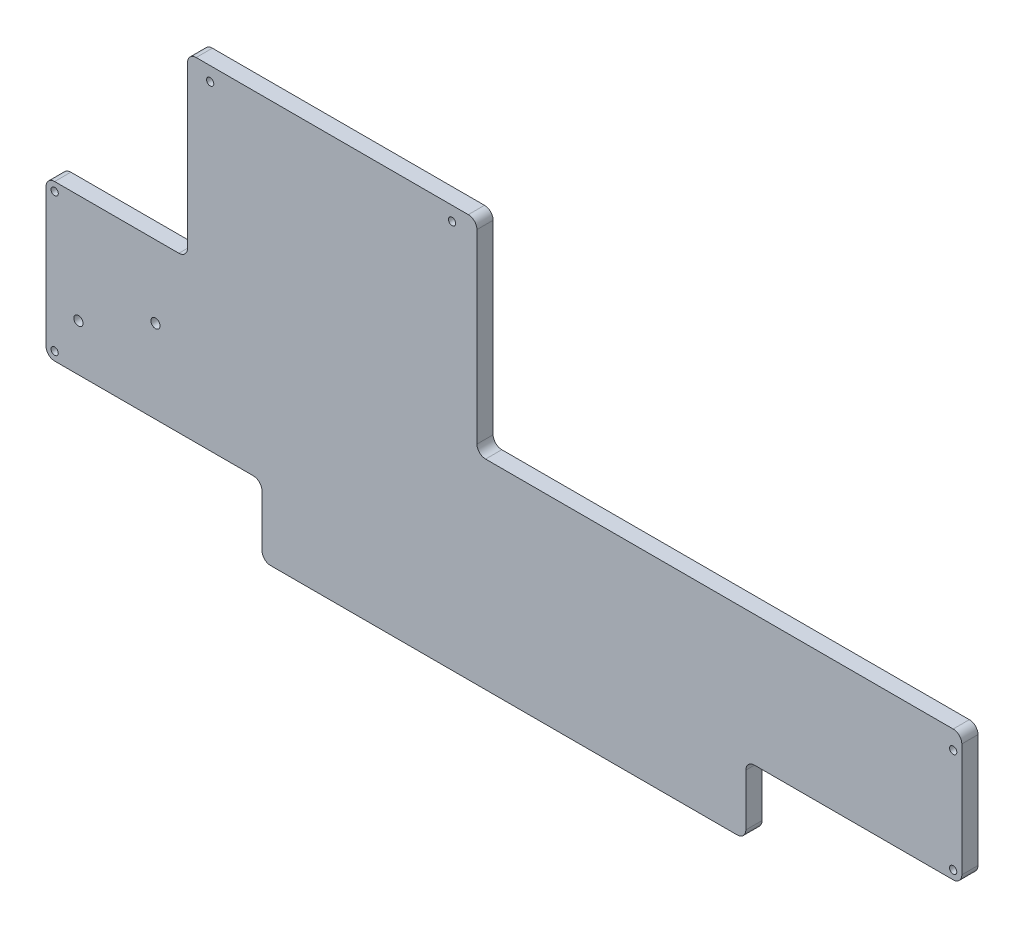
ISO-10303-21;
HEADER;
FILE_DESCRIPTION(('STEP AP214'),'2;1');
FILE_NAME('part.step','',(''),(''),'','','');
FILE_SCHEMA(('AUTOMOTIVE_DESIGN { 1 0 10303 214 1 1 1 1 }'));
ENDSEC;
DATA;
#1=APPLICATION_CONTEXT('core data for automotive mechanical design processes');
#2=APPLICATION_PROTOCOL_DEFINITION('international standard','automotive_design',2000,#1);
#3=PRODUCT_CONTEXT('',#1,'mechanical');
#4=PRODUCT('Part','Part','',(#3));
#5=PRODUCT_RELATED_PRODUCT_CATEGORY('part','',(#4));
#6=PRODUCT_DEFINITION_FORMATION('','',#4);
#7=PRODUCT_DEFINITION_CONTEXT('part definition',#1,'design');
#8=PRODUCT_DEFINITION('design','',#6,#7);
#9=PRODUCT_DEFINITION_SHAPE('','',#8);
#10=(LENGTH_UNIT() NAMED_UNIT(*) SI_UNIT(.MILLI.,.METRE.));
#11=(NAMED_UNIT(*) PLANE_ANGLE_UNIT() SI_UNIT($,.RADIAN.));
#12=(NAMED_UNIT(*) SI_UNIT($,.STERADIAN.) SOLID_ANGLE_UNIT());
#13=UNCERTAINTY_MEASURE_WITH_UNIT(LENGTH_MEASURE(1.E-05),#10,'distance_accuracy_value','');
#14=(GEOMETRIC_REPRESENTATION_CONTEXT(3) GLOBAL_UNCERTAINTY_ASSIGNED_CONTEXT((#13)) GLOBAL_UNIT_ASSIGNED_CONTEXT((#10,
#11,#12)) REPRESENTATION_CONTEXT('',''));
#15=CARTESIAN_POINT('',(0.,0.,0.));
#16=DIRECTION('',(0.,0.,1.));
#17=DIRECTION('',(1.,0.,0.));
#18=AXIS2_PLACEMENT_3D('',#15,#16,#17);
#19=CARTESIAN_POINT('',(3.5527136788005E-12,0.00125000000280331,136.144));
#20=DIRECTION('',(0.,0.,1.));
#21=DIRECTION('',(0.,-1.,0.));
#22=AXIS2_PLACEMENT_3D('',#19,#20,#21);
#23=PLANE('',#22);
#24=CARTESIAN_POINT('',(-215.899999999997,292.1,136.144));
#25=DIRECTION('',(0.,0.,1.));
#26=DIRECTION('',(0.,-1.,0.));
#27=AXIS2_PLACEMENT_3D('',#24,#25,#26);
#28=CIRCLE('',#27,2.667);
#29=CARTESIAN_POINT('',(-215.899999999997,289.433,136.144));
#30=VERTEX_POINT('',#29);
#31=EDGE_CURVE('E11',#30,#30,#28,.T.);
#32=ORIENTED_EDGE('',*,*,#31,.T.);
#33=EDGE_LOOP('',(#32));
#34=FACE_BOUND('',#33,.T.);
#35=CARTESIAN_POINT('',(-38.0999999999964,292.1,136.144));
#36=DIRECTION('',(0.,0.,1.));
#37=DIRECTION('',(0.,-1.,0.));
#38=AXIS2_PLACEMENT_3D('',#35,#36,#37);
#39=CIRCLE('',#38,2.667);
#40=CARTESIAN_POINT('',(-38.0999999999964,289.433,136.144));
#41=VERTEX_POINT('',#40);
#42=EDGE_CURVE('E200',#41,#41,#39,.T.);
#43=ORIENTED_EDGE('',*,*,#42,.T.);
#44=EDGE_LOOP('',(#43));
#45=FACE_BOUND('',#44,.T.);
#46=CARTESIAN_POINT('',(-13.4619999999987,159.512,136.144));
#47=DIRECTION('',(0.,0.,1.));
#48=DIRECTION('',(0.,-1.,0.));
#49=AXIS2_PLACEMENT_3D('',#46,#47,#48);
#50=CIRCLE('',#49,6.35);
#51=CARTESIAN_POINT('',(-19.8119999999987,159.512,136.144));
#52=VERTEX_POINT('',#51);
#53=CARTESIAN_POINT('',(-13.4619999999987,153.162,136.144));
#54=VERTEX_POINT('',#53);
#55=EDGE_CURVE('E492',#52,#54,#50,.T.);
#56=ORIENTED_EDGE('',*,*,#55,.T.);
#57=DIRECTION('',(-1.,0.,0.));
#58=VECTOR('',#57,1.);
#59=CARTESIAN_POINT('',(281.368499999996,153.162,136.144));
#60=LINE('',#59,#58);
#61=CARTESIAN_POINT('',(330.199999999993,153.162,136.144));
#62=VERTEX_POINT('',#61);
#63=EDGE_CURVE('E199',#62,#54,#60,.T.);
#64=ORIENTED_EDGE('',*,*,#63,.F.);
#65=CARTESIAN_POINT('',(330.199999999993,146.812,136.144));
#66=DIRECTION('',(0.,0.,1.));
#67=DIRECTION('',(0.,-1.,0.));
#68=AXIS2_PLACEMENT_3D('',#65,#66,#67);
#69=CIRCLE('',#68,6.35);
#70=CARTESIAN_POINT('',(336.549999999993,146.812,136.144));
#71=VERTEX_POINT('',#70);
#72=EDGE_CURVE('E212',#71,#62,#69,.T.);
#73=ORIENTED_EDGE('',*,*,#72,.F.);
#74=DIRECTION('',(0.,1.,0.));
#75=VECTOR('',#74,1.);
#76=CARTESIAN_POINT('',(336.549999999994,105.156,136.144));
#77=LINE('',#76,#75);
#78=CARTESIAN_POINT('',(336.549999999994,63.4999999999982,136.144));
#79=VERTEX_POINT('',#78);
#80=EDGE_CURVE('E218',#79,#71,#77,.T.);
#81=ORIENTED_EDGE('',*,*,#80,.F.);
#82=CARTESIAN_POINT('',(330.199999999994,63.4999999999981,136.144));
#83=DIRECTION('',(0.,0.,1.));
#84=DIRECTION('',(0.,-1.,0.));
#85=AXIS2_PLACEMENT_3D('',#82,#83,#84);
#86=CIRCLE('',#85,6.35);
#87=CARTESIAN_POINT('',(330.199999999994,57.1499999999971,136.144));
#88=VERTEX_POINT('',#87);
#89=EDGE_CURVE('E227',#88,#79,#86,.T.);
#90=ORIENTED_EDGE('',*,*,#89,.F.);
#91=DIRECTION('',(1.,0.,0.));
#92=VECTOR('',#91,1.);
#93=CARTESIAN_POINT('',(257.175,57.1499999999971,136.144));
#94=LINE('',#93,#92);
#95=CARTESIAN_POINT('',(184.15,57.15,136.144));
#96=VERTEX_POINT('',#95);
#97=EDGE_CURVE('E236',#96,#88,#94,.T.);
#98=ORIENTED_EDGE('',*,*,#97,.F.);
#99=CARTESIAN_POINT('',(184.15,50.8,136.144));
#100=DIRECTION('',(0.,0.,1.));
#101=DIRECTION('',(0.,-1.,0.));
#102=AXIS2_PLACEMENT_3D('',#99,#100,#101);
#103=CIRCLE('',#102,6.35);
#104=CARTESIAN_POINT('',(177.8,50.8,136.144));
#105=VERTEX_POINT('',#104);
#106=EDGE_CURVE('E250',#96,#105,#103,.T.);
#107=ORIENTED_EDGE('',*,*,#106,.T.);
#108=DIRECTION('',(0.,1.,0.));
#109=VECTOR('',#108,1.);
#110=CARTESIAN_POINT('',(177.8,31.7499999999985,136.144));
#111=LINE('',#110,#109);
#112=CARTESIAN_POINT('',(177.8,12.6999999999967,136.144));
#113=VERTEX_POINT('',#112);
#114=EDGE_CURVE('E260',#113,#105,#111,.T.);
#115=ORIENTED_EDGE('',*,*,#114,.F.);
#116=CARTESIAN_POINT('',(171.45,12.6999999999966,136.144));
#117=DIRECTION('',(0.,0.,1.));
#118=DIRECTION('',(0.,-1.,0.));
#119=AXIS2_PLACEMENT_3D('',#116,#117,#118);
#120=CIRCLE('',#119,6.35);
#121=CARTESIAN_POINT('',(171.45,6.34999999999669,136.144));
#122=VERTEX_POINT('',#121);
#123=EDGE_CURVE('E271',#122,#113,#120,.T.);
#124=ORIENTED_EDGE('',*,*,#123,.F.);
#125=DIRECTION('',(1.,0.,0.));
#126=VECTOR('',#125,1.);
#127=CARTESIAN_POINT('',(-2.77555756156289E-13,6.34999999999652,136.144));
#128=LINE('',#127,#126);
#129=CARTESIAN_POINT('',(-171.45,6.34999999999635,136.144));
#130=VERTEX_POINT('',#129);
#131=EDGE_CURVE('E335',#130,#122,#128,.T.);
#132=ORIENTED_EDGE('',*,*,#131,.F.);
#133=CARTESIAN_POINT('',(-171.45,12.6999999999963,136.144));
#134=DIRECTION('',(0.,0.,1.));
#135=DIRECTION('',(0.,-1.,0.));
#136=AXIS2_PLACEMENT_3D('',#133,#134,#135);
#137=CIRCLE('',#136,6.35);
#138=CARTESIAN_POINT('',(-177.8,12.6999999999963,136.144));
#139=VERTEX_POINT('',#138);
#140=EDGE_CURVE('E278',#139,#130,#137,.T.);
#141=ORIENTED_EDGE('',*,*,#140,.F.);
#142=DIRECTION('',(0.,-1.,0.));
#143=VECTOR('',#142,1.);
#144=CARTESIAN_POINT('',(-177.8,31.7499999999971,136.144));
#145=LINE('',#144,#143);
#146=CARTESIAN_POINT('',(-177.8,50.799999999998,136.144));
#147=VERTEX_POINT('',#146);
#148=EDGE_CURVE('E287',#147,#139,#145,.T.);
#149=ORIENTED_EDGE('',*,*,#148,.F.);
#150=CARTESIAN_POINT('',(-184.15,50.799999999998,136.144));
#151=DIRECTION('',(0.,0.,1.));
#152=DIRECTION('',(0.,-1.,0.));
#153=AXIS2_PLACEMENT_3D('',#150,#151,#152);
#154=CIRCLE('',#153,6.35);
#155=CARTESIAN_POINT('',(-184.15,57.1499999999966,136.144));
#156=VERTEX_POINT('',#155);
#157=EDGE_CURVE('E289',#147,#156,#154,.T.);
#158=ORIENTED_EDGE('',*,*,#157,.T.);
#159=DIRECTION('',(1.,0.,0.));
#160=VECTOR('',#159,1.);
#161=CARTESIAN_POINT('',(-257.175,57.1499999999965,136.144));
#162=LINE('',#161,#160);
#163=CARTESIAN_POINT('',(-330.199999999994,57.1499999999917,136.144));
#164=VERTEX_POINT('',#163);
#165=EDGE_CURVE('E304',#164,#156,#162,.T.);
#166=ORIENTED_EDGE('',*,*,#165,.F.);
#167=CARTESIAN_POINT('',(-330.199999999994,63.4999999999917,136.144));
#168=DIRECTION('',(0.,0.,1.));
#169=DIRECTION('',(0.,-1.,0.));
#170=AXIS2_PLACEMENT_3D('',#167,#168,#169);
#171=CIRCLE('',#170,6.35);
#172=CARTESIAN_POINT('',(-336.549999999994,63.4999999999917,136.144));
#173=VERTEX_POINT('',#172);
#174=EDGE_CURVE('E319',#173,#164,#171,.T.);
#175=ORIENTED_EDGE('',*,*,#174,.F.);
#176=DIRECTION('',(0.,-1.,0.));
#177=VECTOR('',#176,1.);
#178=CARTESIAN_POINT('',(-336.549999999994,114.299999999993,136.144));
#179=LINE('',#178,#177);
#180=CARTESIAN_POINT('',(-336.549999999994,165.099999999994,136.144));
#181=VERTEX_POINT('',#180);
#182=EDGE_CURVE('E345',#181,#173,#179,.T.);
#183=ORIENTED_EDGE('',*,*,#182,.F.);
#184=CARTESIAN_POINT('',(-330.199999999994,165.099999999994,136.144));
#185=DIRECTION('',(0.,0.,1.));
#186=DIRECTION('',(0.,-1.,0.));
#187=AXIS2_PLACEMENT_3D('',#184,#185,#186);
#188=CIRCLE('',#187,6.35);
#189=CARTESIAN_POINT('',(-330.199999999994,171.449999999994,136.144));
#190=VERTEX_POINT('',#189);
#191=EDGE_CURVE('E360',#190,#181,#188,.T.);
#192=ORIENTED_EDGE('',*,*,#191,.F.);
#193=DIRECTION('',(-1.,0.,0.));
#194=VECTOR('',#193,1.);
#195=CARTESIAN_POINT('',(-284.543499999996,171.449999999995,136.144));
#196=LINE('',#195,#194);
#197=CARTESIAN_POINT('',(-238.886999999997,171.449999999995,136.144));
#198=VERTEX_POINT('',#197);
#199=EDGE_CURVE('E372',#198,#190,#196,.T.);
#200=ORIENTED_EDGE('',*,*,#199,.F.);
#201=CARTESIAN_POINT('',(-238.886999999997,177.799999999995,136.144));
#202=DIRECTION('',(0.,0.,1.));
#203=DIRECTION('',(0.,-1.,0.));
#204=AXIS2_PLACEMENT_3D('',#201,#202,#203);
#205=CIRCLE('',#204,6.35);
#206=CARTESIAN_POINT('',(-232.536999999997,177.799999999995,136.144));
#207=VERTEX_POINT('',#206);
#208=EDGE_CURVE('E384',#198,#207,#205,.T.);
#209=ORIENTED_EDGE('',*,*,#208,.T.);
#210=DIRECTION('',(0.,-1.,0.));
#211=VECTOR('',#210,1.);
#212=CARTESIAN_POINT('',(-232.537,236.9185,136.144));
#213=LINE('',#212,#211);
#214=CARTESIAN_POINT('',(-232.537,296.037,136.144));
#215=VERTEX_POINT('',#214);
#216=EDGE_CURVE('E396',#215,#207,#213,.T.);
#217=ORIENTED_EDGE('',*,*,#216,.F.);
#218=CARTESIAN_POINT('',(-226.187,296.037,136.144));
#219=DIRECTION('',(0.,0.,1.));
#220=DIRECTION('',(0.,-1.,0.));
#221=AXIS2_PLACEMENT_3D('',#218,#219,#220);
#222=CIRCLE('',#221,6.35);
#223=CARTESIAN_POINT('',(-226.187,302.387,136.144));
#224=VERTEX_POINT('',#223);
#225=EDGE_CURVE('E411',#224,#215,#222,.T.);
#226=ORIENTED_EDGE('',*,*,#225,.F.);
#227=DIRECTION('',(-1.,0.,0.));
#228=VECTOR('',#227,1.);
#229=CARTESIAN_POINT('',(-126.174499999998,302.387,136.144));
#230=LINE('',#229,#228);
#231=CARTESIAN_POINT('',(-26.1619999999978,302.387,136.144));
#232=VERTEX_POINT('',#231);
#233=EDGE_CURVE('E422',#232,#224,#230,.T.);
#234=ORIENTED_EDGE('',*,*,#233,.F.);
#235=CARTESIAN_POINT('',(-26.1619999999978,296.037,136.144));
#236=DIRECTION('',(0.,0.,1.));
#237=DIRECTION('',(0.,-1.,0.));
#238=AXIS2_PLACEMENT_3D('',#235,#236,#237);
#239=CIRCLE('',#238,6.35);
#240=CARTESIAN_POINT('',(-19.8119999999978,296.037,136.144));
#241=VERTEX_POINT('',#240);
#242=EDGE_CURVE('E431',#241,#232,#239,.T.);
#243=ORIENTED_EDGE('',*,*,#242,.F.);
#244=DIRECTION('',(0.,1.,0.));
#245=VECTOR('',#244,1.);
#246=CARTESIAN_POINT('',(-19.8119999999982,227.7745,136.144));
#247=LINE('',#246,#245);
#248=EDGE_CURVE('E461',#52,#241,#247,.T.);
#249=ORIENTED_EDGE('',*,*,#248,.F.);
#250=EDGE_LOOP('',(#56,#64,#73,#81,#90,#98,#107,#115,#124,#132,#141,#149,#158,#166,#175,#183,
#192,#200,#209,#217,#226,#234,#243,#249));
#251=FACE_BOUND('',#250,.T.);
#252=CARTESIAN_POINT('',(330.199999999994,63.50000000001,136.144));
#253=DIRECTION('',(0.,0.,1.));
#254=DIRECTION('',(0.,-1.,0.));
#255=AXIS2_PLACEMENT_3D('',#252,#253,#254);
#256=CIRCLE('',#255,2.667);
#257=CARTESIAN_POINT('',(330.199999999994,60.83300000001,136.144));
#258=VERTEX_POINT('',#257);
#259=EDGE_CURVE('E324',#258,#258,#256,.T.);
#260=ORIENTED_EDGE('',*,*,#259,.T.);
#261=EDGE_LOOP('',(#260));
#262=FACE_BOUND('',#261,.T.);
#263=CARTESIAN_POINT('',(330.199999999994,139.70000000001,136.144));
#264=DIRECTION('',(0.,0.,1.));
#265=DIRECTION('',(0.,-1.,0.));
#266=AXIS2_PLACEMENT_3D('',#263,#264,#265);
#267=CIRCLE('',#266,2.667);
#268=CARTESIAN_POINT('',(330.199999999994,137.03300000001,136.144));
#269=VERTEX_POINT('',#268);
#270=EDGE_CURVE('E193',#269,#269,#267,.T.);
#271=ORIENTED_EDGE('',*,*,#270,.T.);
#272=EDGE_LOOP('',(#271));
#273=FACE_BOUND('',#272,.T.);
#274=CARTESIAN_POINT('',(-330.199999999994,63.499999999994,136.144));
#275=DIRECTION('',(0.,0.,1.));
#276=DIRECTION('',(0.,-1.,0.));
#277=AXIS2_PLACEMENT_3D('',#274,#275,#276);
#278=CIRCLE('',#277,2.667);
#279=CARTESIAN_POINT('',(-330.199999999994,60.832999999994,136.144));
#280=VERTEX_POINT('',#279);
#281=EDGE_CURVE('E186',#280,#280,#278,.T.);
#282=ORIENTED_EDGE('',*,*,#281,.T.);
#283=EDGE_LOOP('',(#282));
#284=FACE_BOUND('',#283,.T.);
#285=CARTESIAN_POINT('',(-330.199999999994,165.099999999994,136.144));
#286=DIRECTION('',(0.,0.,1.));
#287=DIRECTION('',(0.,-1.,0.));
#288=AXIS2_PLACEMENT_3D('',#285,#286,#287);
#289=CIRCLE('',#288,2.667);
#290=CARTESIAN_POINT('',(-330.199999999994,162.432999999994,136.144));
#291=VERTEX_POINT('',#290);
#292=EDGE_CURVE('E185',#291,#291,#289,.T.);
#293=ORIENTED_EDGE('',*,*,#292,.T.);
#294=EDGE_LOOP('',(#293));
#295=FACE_BOUND('',#294,.T.);
#296=CARTESIAN_POINT('',(-256.095499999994,118.237,136.144));
#297=DIRECTION('',(0.,0.,1.));
#298=DIRECTION('',(0.,-1.,0.));
#299=AXIS2_PLACEMENT_3D('',#296,#297,#298);
#300=CIRCLE('',#299,3.3782);
#301=CARTESIAN_POINT('',(-256.095499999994,114.8588,136.144));
#302=VERTEX_POINT('',#301);
#303=EDGE_CURVE('E175',#302,#302,#300,.T.);
#304=ORIENTED_EDGE('',*,*,#303,.T.);
#305=EDGE_LOOP('',(#304));
#306=FACE_BOUND('',#305,.T.);
#307=CARTESIAN_POINT('',(-312.737499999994,91.567,136.144));
#308=DIRECTION('',(0.,0.,1.));
#309=DIRECTION('',(0.,-1.,0.));
#310=AXIS2_PLACEMENT_3D('',#307,#308,#309);
#311=CIRCLE('',#310,3.3782);
#312=CARTESIAN_POINT('',(-312.737499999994,88.1888,136.144));
#313=VERTEX_POINT('',#312);
#314=EDGE_CURVE('E20',#313,#313,#311,.T.);
#315=ORIENTED_EDGE('',*,*,#314,.T.);
#316=EDGE_LOOP('',(#315));
#317=FACE_BOUND('',#316,.T.);
#318=ADVANCED_FACE('F17',(#34,#45,#251,#262,#273,#284,#295,#306,#317),#23,.F.);
#319=CARTESIAN_POINT('',(3.5527136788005E-12,0.00125000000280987,148.050250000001));
#320=DIRECTION('',(0.,0.,1.));
#321=DIRECTION('',(0.,-1.,0.));
#322=AXIS2_PLACEMENT_3D('',#319,#320,#321);
#323=PLANE('',#322);
#324=CARTESIAN_POINT('',(-215.899999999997,292.1,148.050250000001));
#325=DIRECTION('',(0.,0.,1.));
#326=DIRECTION('',(0.,-1.,0.));
#327=AXIS2_PLACEMENT_3D('',#324,#325,#326);
#328=CIRCLE('',#327,2.667);
#329=CARTESIAN_POINT('',(-215.899999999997,289.433,148.050250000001));
#330=VERTEX_POINT('',#329);
#331=EDGE_CURVE('E27',#330,#330,#328,.T.);
#332=ORIENTED_EDGE('',*,*,#331,.F.);
#333=EDGE_LOOP('',(#332));
#334=FACE_BOUND('',#333,.T.);
#335=CARTESIAN_POINT('',(-38.0999999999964,292.1,148.050250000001));
#336=DIRECTION('',(0.,0.,1.));
#337=DIRECTION('',(0.,-1.,0.));
#338=AXIS2_PLACEMENT_3D('',#335,#336,#337);
#339=CIRCLE('',#338,2.667);
#340=CARTESIAN_POINT('',(-38.0999999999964,289.433,148.050250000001));
#341=VERTEX_POINT('',#340);
#342=EDGE_CURVE('E203',#341,#341,#339,.T.);
#343=ORIENTED_EDGE('',*,*,#342,.F.);
#344=EDGE_LOOP('',(#343));
#345=FACE_BOUND('',#344,.T.);
#346=CARTESIAN_POINT('',(-13.4619999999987,159.512,148.050250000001));
#347=DIRECTION('',(0.,0.,1.));
#348=DIRECTION('',(0.,-1.,0.));
#349=AXIS2_PLACEMENT_3D('',#346,#347,#348);
#350=CIRCLE('',#349,6.35);
#351=CARTESIAN_POINT('',(-19.8119999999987,159.512,148.050250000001));
#352=VERTEX_POINT('',#351);
#353=CARTESIAN_POINT('',(-13.4619999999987,153.162,148.050250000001));
#354=VERTEX_POINT('',#353);
#355=EDGE_CURVE('E466',#352,#354,#350,.T.);
#356=ORIENTED_EDGE('',*,*,#355,.F.);
#357=DIRECTION('',(0.,1.,0.));
#358=VECTOR('',#357,1.);
#359=CARTESIAN_POINT('',(-19.8119999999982,227.7745,148.050250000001));
#360=LINE('',#359,#358);
#361=CARTESIAN_POINT('',(-19.8119999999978,296.037,148.050250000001));
#362=VERTEX_POINT('',#361);
#363=EDGE_CURVE('E442',#352,#362,#360,.T.);
#364=ORIENTED_EDGE('',*,*,#363,.T.);
#365=CARTESIAN_POINT('',(-26.1619999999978,296.037,148.050250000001));
#366=DIRECTION('',(0.,0.,1.));
#367=DIRECTION('',(0.,-1.,0.));
#368=AXIS2_PLACEMENT_3D('',#365,#366,#367);
#369=CIRCLE('',#368,6.35);
#370=CARTESIAN_POINT('',(-26.1619999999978,302.387,148.050250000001));
#371=VERTEX_POINT('',#370);
#372=EDGE_CURVE('E426',#362,#371,#369,.T.);
#373=ORIENTED_EDGE('',*,*,#372,.T.);
#374=DIRECTION('',(-1.,0.,0.));
#375=VECTOR('',#374,1.);
#376=CARTESIAN_POINT('',(-126.174499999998,302.387,148.050250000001));
#377=LINE('',#376,#375);
#378=CARTESIAN_POINT('',(-226.187,302.387,148.050250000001));
#379=VERTEX_POINT('',#378);
#380=EDGE_CURVE('E407',#371,#379,#377,.T.);
#381=ORIENTED_EDGE('',*,*,#380,.T.);
#382=CARTESIAN_POINT('',(-226.187,296.037,148.050250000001));
#383=DIRECTION('',(0.,0.,1.));
#384=DIRECTION('',(0.,-1.,0.));
#385=AXIS2_PLACEMENT_3D('',#382,#383,#384);
#386=CIRCLE('',#385,6.35);
#387=CARTESIAN_POINT('',(-232.537,296.037,148.050250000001));
#388=VERTEX_POINT('',#387);
#389=EDGE_CURVE('E400',#379,#388,#386,.T.);
#390=ORIENTED_EDGE('',*,*,#389,.T.);
#391=DIRECTION('',(0.,-1.,0.));
#392=VECTOR('',#391,1.);
#393=CARTESIAN_POINT('',(-232.537,236.9185,148.050250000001));
#394=LINE('',#393,#392);
#395=CARTESIAN_POINT('',(-232.536999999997,177.799999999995,148.050250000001));
#396=VERTEX_POINT('',#395);
#397=EDGE_CURVE('E388',#388,#396,#394,.T.);
#398=ORIENTED_EDGE('',*,*,#397,.T.);
#399=CARTESIAN_POINT('',(-238.886999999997,177.799999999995,148.050250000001));
#400=DIRECTION('',(0.,0.,1.));
#401=DIRECTION('',(0.,-1.,0.));
#402=AXIS2_PLACEMENT_3D('',#399,#400,#401);
#403=CIRCLE('',#402,6.35);
#404=CARTESIAN_POINT('',(-238.886999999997,171.449999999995,148.050250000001));
#405=VERTEX_POINT('',#404);
#406=EDGE_CURVE('E376',#405,#396,#403,.T.);
#407=ORIENTED_EDGE('',*,*,#406,.F.);
#408=DIRECTION('',(-1.,0.,0.));
#409=VECTOR('',#408,1.);
#410=CARTESIAN_POINT('',(-284.543499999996,171.449999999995,148.050250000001));
#411=LINE('',#410,#409);
#412=CARTESIAN_POINT('',(-330.199999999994,171.449999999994,148.050250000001));
#413=VERTEX_POINT('',#412);
#414=EDGE_CURVE('E364',#405,#413,#411,.T.);
#415=ORIENTED_EDGE('',*,*,#414,.T.);
#416=CARTESIAN_POINT('',(-330.199999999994,165.099999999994,148.050250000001));
#417=DIRECTION('',(0.,0.,1.));
#418=DIRECTION('',(0.,-1.,0.));
#419=AXIS2_PLACEMENT_3D('',#416,#417,#418);
#420=CIRCLE('',#419,6.35);
#421=CARTESIAN_POINT('',(-336.549999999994,165.099999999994,148.050250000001));
#422=VERTEX_POINT('',#421);
#423=EDGE_CURVE('E352',#413,#422,#420,.T.);
#424=ORIENTED_EDGE('',*,*,#423,.T.);
#425=DIRECTION('',(0.,-1.,0.));
#426=VECTOR('',#425,1.);
#427=CARTESIAN_POINT('',(-336.549999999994,114.299999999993,148.050250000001));
#428=LINE('',#427,#426);
#429=CARTESIAN_POINT('',(-336.549999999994,63.4999999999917,148.050250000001));
#430=VERTEX_POINT('',#429);
#431=EDGE_CURVE('E331',#422,#430,#428,.T.);
#432=ORIENTED_EDGE('',*,*,#431,.T.);
#433=CARTESIAN_POINT('',(-330.199999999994,63.4999999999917,148.050250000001));
#434=DIRECTION('',(0.,0.,1.));
#435=DIRECTION('',(0.,-1.,0.));
#436=AXIS2_PLACEMENT_3D('',#433,#434,#435);
#437=CIRCLE('',#436,6.35);
#438=CARTESIAN_POINT('',(-330.199999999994,57.1499999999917,148.050250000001));
#439=VERTEX_POINT('',#438);
#440=EDGE_CURVE('E308',#430,#439,#437,.T.);
#441=ORIENTED_EDGE('',*,*,#440,.T.);
#442=DIRECTION('',(1.,0.,0.));
#443=VECTOR('',#442,1.);
#444=CARTESIAN_POINT('',(-257.175,57.1499999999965,148.050250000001));
#445=LINE('',#444,#443);
#446=CARTESIAN_POINT('',(-184.15,57.1499999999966,148.050250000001));
#447=VERTEX_POINT('',#446);
#448=EDGE_CURVE('E293',#439,#447,#445,.T.);
#449=ORIENTED_EDGE('',*,*,#448,.T.);
#450=CARTESIAN_POINT('',(-184.15,50.7999999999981,148.050250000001));
#451=DIRECTION('',(0.,0.,1.));
#452=DIRECTION('',(0.,-1.,0.));
#453=AXIS2_PLACEMENT_3D('',#450,#451,#452);
#454=CIRCLE('',#453,6.35);
#455=CARTESIAN_POINT('',(-177.8,50.799999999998,148.050250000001));
#456=VERTEX_POINT('',#455);
#457=EDGE_CURVE('E283',#456,#447,#454,.T.);
#458=ORIENTED_EDGE('',*,*,#457,.F.);
#459=DIRECTION('',(0.,-1.,0.));
#460=VECTOR('',#459,1.);
#461=CARTESIAN_POINT('',(-177.8,31.7499999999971,148.050250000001));
#462=LINE('',#461,#460);
#463=CARTESIAN_POINT('',(-177.8,12.6999999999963,148.050250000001));
#464=VERTEX_POINT('',#463);
#465=EDGE_CURVE('E282',#456,#464,#462,.T.);
#466=ORIENTED_EDGE('',*,*,#465,.T.);
#467=CARTESIAN_POINT('',(-171.45,12.6999999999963,148.050250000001));
#468=DIRECTION('',(0.,0.,1.));
#469=DIRECTION('',(0.,-1.,0.));
#470=AXIS2_PLACEMENT_3D('',#467,#468,#469);
#471=CIRCLE('',#470,6.35);
#472=CARTESIAN_POINT('',(-171.45,6.34999999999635,148.050250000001));
#473=VERTEX_POINT('',#472);
#474=EDGE_CURVE('E277',#464,#473,#471,.T.);
#475=ORIENTED_EDGE('',*,*,#474,.T.);
#476=DIRECTION('',(1.,0.,0.));
#477=VECTOR('',#476,1.);
#478=CARTESIAN_POINT('',(-2.77555756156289E-13,6.34999999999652,148.050250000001));
#479=LINE('',#478,#477);
#480=CARTESIAN_POINT('',(171.45,6.3499999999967,148.050250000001));
#481=VERTEX_POINT('',#480);
#482=EDGE_CURVE('E267',#473,#481,#479,.T.);
#483=ORIENTED_EDGE('',*,*,#482,.T.);
#484=CARTESIAN_POINT('',(171.45,12.6999999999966,148.050250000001));
#485=DIRECTION('',(0.,0.,1.));
#486=DIRECTION('',(0.,-1.,0.));
#487=AXIS2_PLACEMENT_3D('',#484,#485,#486);
#488=CIRCLE('',#487,6.35);
#489=CARTESIAN_POINT('',(177.8,12.6999999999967,148.050250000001));
#490=VERTEX_POINT('',#489);
#491=EDGE_CURVE('E262',#481,#490,#488,.T.);
#492=ORIENTED_EDGE('',*,*,#491,.T.);
#493=DIRECTION('',(0.,1.,0.));
#494=VECTOR('',#493,1.);
#495=CARTESIAN_POINT('',(177.8,31.7499999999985,148.050250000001));
#496=LINE('',#495,#494);
#497=CARTESIAN_POINT('',(177.8,50.8,148.050250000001));
#498=VERTEX_POINT('',#497);
#499=EDGE_CURVE('E253',#490,#498,#496,.T.);
#500=ORIENTED_EDGE('',*,*,#499,.T.);
#501=CARTESIAN_POINT('',(184.15,50.8,148.050250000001));
#502=DIRECTION('',(0.,0.,1.));
#503=DIRECTION('',(0.,-1.,0.));
#504=AXIS2_PLACEMENT_3D('',#501,#502,#503);
#505=CIRCLE('',#504,6.35);
#506=CARTESIAN_POINT('',(184.15,57.15,148.050250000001));
#507=VERTEX_POINT('',#506);
#508=EDGE_CURVE('E240',#507,#498,#505,.T.);
#509=ORIENTED_EDGE('',*,*,#508,.F.);
#510=DIRECTION('',(1.,0.,0.));
#511=VECTOR('',#510,1.);
#512=CARTESIAN_POINT('',(257.175,57.1499999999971,148.050250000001));
#513=LINE('',#512,#511);
#514=CARTESIAN_POINT('',(330.199999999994,57.1499999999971,148.050250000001));
#515=VERTEX_POINT('',#514);
#516=EDGE_CURVE('E231',#507,#515,#513,.T.);
#517=ORIENTED_EDGE('',*,*,#516,.T.);
#518=CARTESIAN_POINT('',(330.199999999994,63.4999999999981,148.050250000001));
#519=DIRECTION('',(0.,0.,1.));
#520=DIRECTION('',(0.,-1.,0.));
#521=AXIS2_PLACEMENT_3D('',#518,#519,#520);
#522=CIRCLE('',#521,6.35);
#523=CARTESIAN_POINT('',(336.549999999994,63.4999999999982,148.050250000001));
#524=VERTEX_POINT('',#523);
#525=EDGE_CURVE('E222',#515,#524,#522,.T.);
#526=ORIENTED_EDGE('',*,*,#525,.T.);
#527=DIRECTION('',(0.,1.,0.));
#528=VECTOR('',#527,1.);
#529=CARTESIAN_POINT('',(336.549999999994,105.156,148.050250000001));
#530=LINE('',#529,#528);
#531=CARTESIAN_POINT('',(336.549999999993,146.812,148.050250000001));
#532=VERTEX_POINT('',#531);
#533=EDGE_CURVE('E213',#524,#532,#530,.T.);
#534=ORIENTED_EDGE('',*,*,#533,.T.);
#535=CARTESIAN_POINT('',(330.199999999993,146.812,148.050250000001));
#536=DIRECTION('',(0.,0.,1.));
#537=DIRECTION('',(0.,-1.,0.));
#538=AXIS2_PLACEMENT_3D('',#535,#536,#537);
#539=CIRCLE('',#538,6.35);
#540=CARTESIAN_POINT('',(330.199999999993,153.162,148.050250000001));
#541=VERTEX_POINT('',#540);
#542=EDGE_CURVE('E204',#532,#541,#539,.T.);
#543=ORIENTED_EDGE('',*,*,#542,.T.);
#544=DIRECTION('',(-1.,0.,0.));
#545=VECTOR('',#544,1.);
#546=CARTESIAN_POINT('',(281.368499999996,153.162,148.050250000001));
#547=LINE('',#546,#545);
#548=EDGE_CURVE('E194',#541,#354,#547,.T.);
#549=ORIENTED_EDGE('',*,*,#548,.T.);
#550=EDGE_LOOP('',(#356,#364,#373,#381,#390,#398,#407,#415,#424,#432,#441,#449,#458,#466,#475,
#483,#492,#500,#509,#517,#526,#534,#543,#549));
#551=FACE_BOUND('',#550,.T.);
#552=CARTESIAN_POINT('',(330.199999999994,63.50000000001,148.050250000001));
#553=DIRECTION('',(0.,0.,1.));
#554=DIRECTION('',(0.,-1.,0.));
#555=AXIS2_PLACEMENT_3D('',#552,#553,#554);
#556=CIRCLE('',#555,2.667);
#557=CARTESIAN_POINT('',(330.199999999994,60.83300000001,148.050250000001));
#558=VERTEX_POINT('',#557);
#559=EDGE_CURVE('E198',#558,#558,#556,.T.);
#560=ORIENTED_EDGE('',*,*,#559,.F.);
#561=EDGE_LOOP('',(#560));
#562=FACE_BOUND('',#561,.T.);
#563=CARTESIAN_POINT('',(330.199999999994,139.70000000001,148.050250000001));
#564=DIRECTION('',(0.,0.,1.));
#565=DIRECTION('',(0.,-1.,0.));
#566=AXIS2_PLACEMENT_3D('',#563,#564,#565);
#567=CIRCLE('',#566,2.667);
#568=CARTESIAN_POINT('',(330.199999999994,137.03300000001,148.050250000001));
#569=VERTEX_POINT('',#568);
#570=EDGE_CURVE('E327',#569,#569,#567,.T.);
#571=ORIENTED_EDGE('',*,*,#570,.F.);
#572=EDGE_LOOP('',(#571));
#573=FACE_BOUND('',#572,.T.);
#574=CARTESIAN_POINT('',(-330.199999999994,63.499999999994,148.050250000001));
#575=DIRECTION('',(0.,0.,1.));
#576=DIRECTION('',(0.,-1.,0.));
#577=AXIS2_PLACEMENT_3D('',#574,#575,#576);
#578=CIRCLE('',#577,2.667);
#579=CARTESIAN_POINT('',(-330.199999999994,60.832999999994,148.050250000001));
#580=VERTEX_POINT('',#579);
#581=EDGE_CURVE('E190',#580,#580,#578,.T.);
#582=ORIENTED_EDGE('',*,*,#581,.F.);
#583=EDGE_LOOP('',(#582));
#584=FACE_BOUND('',#583,.T.);
#585=CARTESIAN_POINT('',(-330.199999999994,165.099999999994,148.050250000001));
#586=DIRECTION('',(0.,0.,1.));
#587=DIRECTION('',(0.,-1.,0.));
#588=AXIS2_PLACEMENT_3D('',#585,#586,#587);
#589=CIRCLE('',#588,2.667);
#590=CARTESIAN_POINT('',(-330.199999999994,162.432999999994,148.050250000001));
#591=VERTEX_POINT('',#590);
#592=EDGE_CURVE('E189',#591,#591,#589,.T.);
#593=ORIENTED_EDGE('',*,*,#592,.F.);
#594=EDGE_LOOP('',(#593));
#595=FACE_BOUND('',#594,.T.);
#596=CARTESIAN_POINT('',(-256.095499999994,118.237,148.050250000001));
#597=DIRECTION('',(0.,0.,1.));
#598=DIRECTION('',(0.,-1.,0.));
#599=AXIS2_PLACEMENT_3D('',#596,#597,#598);
#600=CIRCLE('',#599,3.3782);
#601=CARTESIAN_POINT('',(-256.095499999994,114.8588,148.050250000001));
#602=VERTEX_POINT('',#601);
#603=EDGE_CURVE('E180',#602,#602,#600,.T.);
#604=ORIENTED_EDGE('',*,*,#603,.F.);
#605=EDGE_LOOP('',(#604));
#606=FACE_BOUND('',#605,.T.);
#607=CARTESIAN_POINT('',(-312.737499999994,91.567,148.050250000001));
#608=DIRECTION('',(0.,0.,1.));
#609=DIRECTION('',(0.,-1.,0.));
#610=AXIS2_PLACEMENT_3D('',#607,#608,#609);
#611=CIRCLE('',#610,3.3782);
#612=CARTESIAN_POINT('',(-312.737499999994,88.1888,148.050250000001));
#613=VERTEX_POINT('',#612);
#614=EDGE_CURVE('E169',#613,#613,#611,.T.);
#615=ORIENTED_EDGE('',*,*,#614,.F.);
#616=EDGE_LOOP('',(#615));
#617=FACE_BOUND('',#616,.T.);
#618=ADVANCED_FACE('F676',(#334,#345,#551,#562,#573,#584,#595,#606,#617),#323,.T.);
#619=CARTESIAN_POINT('',(-215.899999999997,292.1,148.050250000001));
#620=DIRECTION('',(0.,0.,-1.));
#621=DIRECTION('',(0.,1.,0.));
#622=AXIS2_PLACEMENT_3D('',#619,#620,#621);
#623=CYLINDRICAL_SURFACE('',#622,2.667);
#624=ORIENTED_EDGE('',*,*,#31,.F.);
#625=EDGE_LOOP('',(#624));
#626=FACE_BOUND('',#625,.T.);
#627=ORIENTED_EDGE('',*,*,#331,.T.);
#628=EDGE_LOOP('',(#627));
#629=FACE_BOUND('',#628,.T.);
#630=ADVANCED_FACE('F717',(#626,#629),#623,.F.);
#631=CARTESIAN_POINT('',(-312.737499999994,91.567,148.050250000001));
#632=DIRECTION('',(0.,0.,-1.));
#633=DIRECTION('',(0.,1.,0.));
#634=AXIS2_PLACEMENT_3D('',#631,#632,#633);
#635=CYLINDRICAL_SURFACE('',#634,3.3782);
#636=ORIENTED_EDGE('',*,*,#314,.F.);
#637=EDGE_LOOP('',(#636));
#638=FACE_BOUND('',#637,.T.);
#639=ORIENTED_EDGE('',*,*,#614,.T.);
#640=EDGE_LOOP('',(#639));
#641=FACE_BOUND('',#640,.T.);
#642=ADVANCED_FACE('F726',(#638,#641),#635,.F.);
#643=CARTESIAN_POINT('',(-256.095499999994,118.237,148.050250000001));
#644=DIRECTION('',(0.,0.,-1.));
#645=DIRECTION('',(0.,1.,0.));
#646=AXIS2_PLACEMENT_3D('',#643,#644,#645);
#647=CYLINDRICAL_SURFACE('',#646,3.3782);
#648=ORIENTED_EDGE('',*,*,#303,.F.);
#649=EDGE_LOOP('',(#648));
#650=FACE_BOUND('',#649,.T.);
#651=ORIENTED_EDGE('',*,*,#603,.T.);
#652=EDGE_LOOP('',(#651));
#653=FACE_BOUND('',#652,.T.);
#654=ADVANCED_FACE('F721',(#650,#653),#647,.F.);
#655=CARTESIAN_POINT('',(-330.199999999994,165.099999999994,148.050250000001));
#656=DIRECTION('',(0.,0.,-1.));
#657=DIRECTION('',(0.,1.,0.));
#658=AXIS2_PLACEMENT_3D('',#655,#656,#657);
#659=CYLINDRICAL_SURFACE('',#658,2.667);
#660=ORIENTED_EDGE('',*,*,#292,.F.);
#661=EDGE_LOOP('',(#660));
#662=FACE_BOUND('',#661,.T.);
#663=ORIENTED_EDGE('',*,*,#592,.T.);
#664=EDGE_LOOP('',(#663));
#665=FACE_BOUND('',#664,.T.);
#666=ADVANCED_FACE('F725',(#662,#665),#659,.F.);
#667=CARTESIAN_POINT('',(-330.199999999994,63.499999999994,148.050250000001));
#668=DIRECTION('',(0.,0.,-1.));
#669=DIRECTION('',(0.,1.,0.));
#670=AXIS2_PLACEMENT_3D('',#667,#668,#669);
#671=CYLINDRICAL_SURFACE('',#670,2.667);
#672=ORIENTED_EDGE('',*,*,#281,.F.);
#673=EDGE_LOOP('',(#672));
#674=FACE_BOUND('',#673,.T.);
#675=ORIENTED_EDGE('',*,*,#581,.T.);
#676=EDGE_LOOP('',(#675));
#677=FACE_BOUND('',#676,.T.);
#678=ADVANCED_FACE('F734',(#674,#677),#671,.F.);
#679=CARTESIAN_POINT('',(330.199999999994,139.70000000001,148.050250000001));
#680=DIRECTION('',(0.,0.,-1.));
#681=DIRECTION('',(0.,1.,0.));
#682=AXIS2_PLACEMENT_3D('',#679,#680,#681);
#683=CYLINDRICAL_SURFACE('',#682,2.667);
#684=ORIENTED_EDGE('',*,*,#270,.F.);
#685=EDGE_LOOP('',(#684));
#686=FACE_BOUND('',#685,.T.);
#687=ORIENTED_EDGE('',*,*,#570,.T.);
#688=EDGE_LOOP('',(#687));
#689=FACE_BOUND('',#688,.T.);
#690=ADVANCED_FACE('F742',(#686,#689),#683,.F.);
#691=CARTESIAN_POINT('',(330.199999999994,63.50000000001,148.050250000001));
#692=DIRECTION('',(0.,0.,-1.));
#693=DIRECTION('',(0.,1.,0.));
#694=AXIS2_PLACEMENT_3D('',#691,#692,#693);
#695=CYLINDRICAL_SURFACE('',#694,2.667);
#696=ORIENTED_EDGE('',*,*,#259,.F.);
#697=EDGE_LOOP('',(#696));
#698=FACE_BOUND('',#697,.T.);
#699=ORIENTED_EDGE('',*,*,#559,.T.);
#700=EDGE_LOOP('',(#699));
#701=FACE_BOUND('',#700,.T.);
#702=ADVANCED_FACE('F747',(#698,#701),#695,.F.);
#703=CARTESIAN_POINT('',(281.368499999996,153.162,148.050250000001));
#704=DIRECTION('',(0.,-1.,0.));
#705=DIRECTION('',(-1.,0.,0.));
#706=AXIS2_PLACEMENT_3D('',#703,#704,#705);
#707=PLANE('',#706);
#708=ORIENTED_EDGE('',*,*,#63,.T.);
#709=DIRECTION('',(0.,0.,-1.));
#710=VECTOR('',#709,1.);
#711=CARTESIAN_POINT('',(-13.4619999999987,153.162,148.050250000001));
#712=LINE('',#711,#710);
#713=EDGE_CURVE('E462',#354,#54,#712,.T.);
#714=ORIENTED_EDGE('',*,*,#713,.F.);
#715=ORIENTED_EDGE('',*,*,#548,.F.);
#716=DIRECTION('',(0.,0.,-1.));
#717=VECTOR('',#716,1.);
#718=CARTESIAN_POINT('',(330.199999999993,153.162,148.050250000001));
#719=LINE('',#718,#717);
#720=EDGE_CURVE('E208',#541,#62,#719,.T.);
#721=ORIENTED_EDGE('',*,*,#720,.T.);
#722=EDGE_LOOP('',(#708,#714,#715,#721));
#723=FACE_BOUND('',#722,.T.);
#724=ADVANCED_FACE('F680',(#723),#707,.F.);
#725=CARTESIAN_POINT('',(-38.0999999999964,292.1,148.050250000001));
#726=DIRECTION('',(0.,0.,-1.));
#727=DIRECTION('',(0.,1.,0.));
#728=AXIS2_PLACEMENT_3D('',#725,#726,#727);
#729=CYLINDRICAL_SURFACE('',#728,2.667);
#730=ORIENTED_EDGE('',*,*,#42,.F.);
#731=EDGE_LOOP('',(#730));
#732=FACE_BOUND('',#731,.T.);
#733=ORIENTED_EDGE('',*,*,#342,.T.);
#734=EDGE_LOOP('',(#733));
#735=FACE_BOUND('',#734,.T.);
#736=ADVANCED_FACE('F758',(#732,#735),#729,.F.);
#737=CARTESIAN_POINT('',(330.199999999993,146.812,148.050250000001));
#738=DIRECTION('',(0.,0.,-1.));
#739=DIRECTION('',(0.,1.,0.));
#740=AXIS2_PLACEMENT_3D('',#737,#738,#739);
#741=CYLINDRICAL_SURFACE('',#740,6.35);
#742=ORIENTED_EDGE('',*,*,#72,.T.);
#743=ORIENTED_EDGE('',*,*,#720,.F.);
#744=ORIENTED_EDGE('',*,*,#542,.F.);
#745=DIRECTION('',(0.,0.,-1.));
#746=VECTOR('',#745,1.);
#747=CARTESIAN_POINT('',(336.549999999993,146.812,148.050250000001));
#748=LINE('',#747,#746);
#749=EDGE_CURVE('E217',#532,#71,#748,.T.);
#750=ORIENTED_EDGE('',*,*,#749,.T.);
#751=EDGE_LOOP('',(#742,#743,#744,#750));
#752=FACE_BOUND('',#751,.T.);
#753=ADVANCED_FACE('F682',(#752),#741,.T.);
#754=CARTESIAN_POINT('',(336.549999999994,105.156,148.050250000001));
#755=DIRECTION('',(-1.,0.,0.));
#756=DIRECTION('',(0.,1.,0.));
#757=AXIS2_PLACEMENT_3D('',#754,#755,#756);
#758=PLANE('',#757);
#759=ORIENTED_EDGE('',*,*,#80,.T.);
#760=ORIENTED_EDGE('',*,*,#749,.F.);
#761=ORIENTED_EDGE('',*,*,#533,.F.);
#762=DIRECTION('',(0.,0.,-1.));
#763=VECTOR('',#762,1.);
#764=CARTESIAN_POINT('',(336.549999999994,63.4999999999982,148.050250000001));
#765=LINE('',#764,#763);
#766=EDGE_CURVE('E223',#524,#79,#765,.T.);
#767=ORIENTED_EDGE('',*,*,#766,.T.);
#768=EDGE_LOOP('',(#759,#760,#761,#767));
#769=FACE_BOUND('',#768,.T.);
#770=ADVANCED_FACE('F686',(#769),#758,.F.);
#771=CARTESIAN_POINT('',(330.199999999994,63.4999999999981,148.050250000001));
#772=DIRECTION('',(0.,0.,-1.));
#773=DIRECTION('',(0.,1.,0.));
#774=AXIS2_PLACEMENT_3D('',#771,#772,#773);
#775=CYLINDRICAL_SURFACE('',#774,6.35);
#776=ORIENTED_EDGE('',*,*,#89,.T.);
#777=ORIENTED_EDGE('',*,*,#766,.F.);
#778=ORIENTED_EDGE('',*,*,#525,.F.);
#779=DIRECTION('',(0.,0.,-1.));
#780=VECTOR('',#779,1.);
#781=CARTESIAN_POINT('',(330.199999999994,57.1499999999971,148.050250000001));
#782=LINE('',#781,#780);
#783=EDGE_CURVE('E232',#515,#88,#782,.T.);
#784=ORIENTED_EDGE('',*,*,#783,.T.);
#785=EDGE_LOOP('',(#776,#777,#778,#784));
#786=FACE_BOUND('',#785,.T.);
#787=ADVANCED_FACE('F688',(#786),#775,.T.);
#788=CARTESIAN_POINT('',(257.175,57.1499999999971,148.050250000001));
#789=DIRECTION('',(0.,1.,0.));
#790=DIRECTION('',(1.,0.,0.));
#791=AXIS2_PLACEMENT_3D('',#788,#789,#790);
#792=PLANE('',#791);
#793=ORIENTED_EDGE('',*,*,#97,.T.);
#794=ORIENTED_EDGE('',*,*,#783,.F.);
#795=ORIENTED_EDGE('',*,*,#516,.F.);
#796=DIRECTION('',(0.,0.,-1.));
#797=VECTOR('',#796,1.);
#798=CARTESIAN_POINT('',(184.15,57.15,148.050250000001));
#799=LINE('',#798,#797);
#800=EDGE_CURVE('E246',#507,#96,#799,.T.);
#801=ORIENTED_EDGE('',*,*,#800,.T.);
#802=EDGE_LOOP('',(#793,#794,#795,#801));
#803=FACE_BOUND('',#802,.T.);
#804=ADVANCED_FACE('F691',(#803),#792,.F.);
#805=CARTESIAN_POINT('',(184.15,50.8,148.050250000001));
#806=DIRECTION('',(0.,0.,-1.));
#807=DIRECTION('',(0.,1.,0.));
#808=AXIS2_PLACEMENT_3D('',#805,#806,#807);
#809=CYLINDRICAL_SURFACE('',#808,6.35);
#810=ORIENTED_EDGE('',*,*,#106,.F.);
#811=ORIENTED_EDGE('',*,*,#800,.F.);
#812=ORIENTED_EDGE('',*,*,#508,.T.);
#813=DIRECTION('',(0.,0.,-1.));
#814=VECTOR('',#813,1.);
#815=CARTESIAN_POINT('',(177.8,50.8,148.050250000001));
#816=LINE('',#815,#814);
#817=EDGE_CURVE('E257',#498,#105,#816,.T.);
#818=ORIENTED_EDGE('',*,*,#817,.T.);
#819=EDGE_LOOP('',(#810,#811,#812,#818));
#820=FACE_BOUND('',#819,.T.);
#821=ADVANCED_FACE('F696',(#820),#809,.F.);
#822=CARTESIAN_POINT('',(177.8,31.7499999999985,148.050250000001));
#823=DIRECTION('',(-1.,0.,0.));
#824=DIRECTION('',(0.,1.,0.));
#825=AXIS2_PLACEMENT_3D('',#822,#823,#824);
#826=PLANE('',#825);
#827=ORIENTED_EDGE('',*,*,#114,.T.);
#828=ORIENTED_EDGE('',*,*,#817,.F.);
#829=ORIENTED_EDGE('',*,*,#499,.F.);
#830=DIRECTION('',(0.,0.,-1.));
#831=VECTOR('',#830,1.);
#832=CARTESIAN_POINT('',(177.8,12.6999999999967,148.050250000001));
#833=LINE('',#832,#831);
#834=EDGE_CURVE('E266',#490,#113,#833,.T.);
#835=ORIENTED_EDGE('',*,*,#834,.T.);
#836=EDGE_LOOP('',(#827,#828,#829,#835));
#837=FACE_BOUND('',#836,.T.);
#838=ADVANCED_FACE('F699',(#837),#826,.F.);
#839=CARTESIAN_POINT('',(171.45,12.6999999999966,148.050250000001));
#840=DIRECTION('',(0.,0.,-1.));
#841=DIRECTION('',(0.,1.,0.));
#842=AXIS2_PLACEMENT_3D('',#839,#840,#841);
#843=CYLINDRICAL_SURFACE('',#842,6.35);
#844=ORIENTED_EDGE('',*,*,#123,.T.);
#845=ORIENTED_EDGE('',*,*,#834,.F.);
#846=ORIENTED_EDGE('',*,*,#491,.F.);
#847=DIRECTION('',(0.,0.,-1.));
#848=VECTOR('',#847,1.);
#849=CARTESIAN_POINT('',(171.45,6.3499999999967,148.050250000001));
#850=LINE('',#849,#848);
#851=EDGE_CURVE('E272',#481,#122,#850,.T.);
#852=ORIENTED_EDGE('',*,*,#851,.T.);
#853=EDGE_LOOP('',(#844,#845,#846,#852));
#854=FACE_BOUND('',#853,.T.);
#855=ADVANCED_FACE('F702',(#854),#843,.T.);
#856=CARTESIAN_POINT('',(-2.77555756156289E-13,6.34999999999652,148.050250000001));
#857=DIRECTION('',(0.,1.,0.));
#858=DIRECTION('',(1.,0.,0.));
#859=AXIS2_PLACEMENT_3D('',#856,#857,#858);
#860=PLANE('',#859);
#861=ORIENTED_EDGE('',*,*,#131,.T.);
#862=ORIENTED_EDGE('',*,*,#851,.F.);
#863=ORIENTED_EDGE('',*,*,#482,.F.);
#864=DIRECTION('',(0.,0.,-1.));
#865=VECTOR('',#864,1.);
#866=CARTESIAN_POINT('',(-171.45,6.34999999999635,148.050250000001));
#867=LINE('',#866,#865);
#868=EDGE_CURVE('E273',#473,#130,#867,.T.);
#869=ORIENTED_EDGE('',*,*,#868,.T.);
#870=EDGE_LOOP('',(#861,#862,#863,#869));
#871=FACE_BOUND('',#870,.T.);
#872=ADVANCED_FACE('F628',(#871),#860,.F.);
#873=CARTESIAN_POINT('',(-171.45,12.6999999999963,148.050250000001));
#874=DIRECTION('',(0.,0.,-1.));
#875=DIRECTION('',(0.,1.,0.));
#876=AXIS2_PLACEMENT_3D('',#873,#874,#875);
#877=CYLINDRICAL_SURFACE('',#876,6.35);
#878=ORIENTED_EDGE('',*,*,#140,.T.);
#879=ORIENTED_EDGE('',*,*,#868,.F.);
#880=ORIENTED_EDGE('',*,*,#474,.F.);
#881=DIRECTION('',(0.,0.,-1.));
#882=VECTOR('',#881,1.);
#883=CARTESIAN_POINT('',(-177.8,12.6999999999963,148.050250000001));
#884=LINE('',#883,#882);
#885=EDGE_CURVE('E323',#464,#139,#884,.T.);
#886=ORIENTED_EDGE('',*,*,#885,.T.);
#887=EDGE_LOOP('',(#878,#879,#880,#886));
#888=FACE_BOUND('',#887,.T.);
#889=ADVANCED_FACE('F629',(#888),#877,.T.);
#890=CARTESIAN_POINT('',(-177.8,31.7499999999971,148.050250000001));
#891=DIRECTION('',(1.,0.,0.));
#892=DIRECTION('',(0.,1.,0.));
#893=AXIS2_PLACEMENT_3D('',#890,#891,#892);
#894=PLANE('',#893);
#895=ORIENTED_EDGE('',*,*,#148,.T.);
#896=ORIENTED_EDGE('',*,*,#885,.F.);
#897=ORIENTED_EDGE('',*,*,#465,.F.);
#898=DIRECTION('',(0.,0.,-1.));
#899=VECTOR('',#898,1.);
#900=CARTESIAN_POINT('',(-177.8,50.799999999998,148.050250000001));
#901=LINE('',#900,#899);
#902=EDGE_CURVE('E288',#456,#147,#901,.T.);
#903=ORIENTED_EDGE('',*,*,#902,.T.);
#904=EDGE_LOOP('',(#895,#896,#897,#903));
#905=FACE_BOUND('',#904,.T.);
#906=ADVANCED_FACE('F632',(#905),#894,.F.);
#907=CARTESIAN_POINT('',(-184.15,50.7999999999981,148.050250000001));
#908=DIRECTION('',(0.,0.,-1.));
#909=DIRECTION('',(0.,1.,0.));
#910=AXIS2_PLACEMENT_3D('',#907,#908,#909);
#911=CYLINDRICAL_SURFACE('',#910,6.35);
#912=ORIENTED_EDGE('',*,*,#157,.F.);
#913=ORIENTED_EDGE('',*,*,#902,.F.);
#914=ORIENTED_EDGE('',*,*,#457,.T.);
#915=DIRECTION('',(0.,0.,-1.));
#916=VECTOR('',#915,1.);
#917=CARTESIAN_POINT('',(-184.15,57.1499999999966,148.050250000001));
#918=LINE('',#917,#916);
#919=EDGE_CURVE('E300',#447,#156,#918,.T.);
#920=ORIENTED_EDGE('',*,*,#919,.T.);
#921=EDGE_LOOP('',(#912,#913,#914,#920));
#922=FACE_BOUND('',#921,.T.);
#923=ADVANCED_FACE('F637',(#922),#911,.F.);
#924=CARTESIAN_POINT('',(-257.175,57.1499999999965,148.050250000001));
#925=DIRECTION('',(0.,1.,0.));
#926=DIRECTION('',(1.,0.,0.));
#927=AXIS2_PLACEMENT_3D('',#924,#925,#926);
#928=PLANE('',#927);
#929=ORIENTED_EDGE('',*,*,#165,.T.);
#930=ORIENTED_EDGE('',*,*,#919,.F.);
#931=ORIENTED_EDGE('',*,*,#448,.F.);
#932=DIRECTION('',(0.,0.,-1.));
#933=VECTOR('',#932,1.);
#934=CARTESIAN_POINT('',(-330.199999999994,57.1499999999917,148.050250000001));
#935=LINE('',#934,#933);
#936=EDGE_CURVE('E312',#439,#164,#935,.T.);
#937=ORIENTED_EDGE('',*,*,#936,.T.);
#938=EDGE_LOOP('',(#929,#930,#931,#937));
#939=FACE_BOUND('',#938,.T.);
#940=ADVANCED_FACE('F640',(#939),#928,.F.);
#941=CARTESIAN_POINT('',(-330.199999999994,63.4999999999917,148.050250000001));
#942=DIRECTION('',(0.,0.,-1.));
#943=DIRECTION('',(0.,1.,0.));
#944=AXIS2_PLACEMENT_3D('',#941,#942,#943);
#945=CYLINDRICAL_SURFACE('',#944,6.35);
#946=ORIENTED_EDGE('',*,*,#174,.T.);
#947=ORIENTED_EDGE('',*,*,#936,.F.);
#948=ORIENTED_EDGE('',*,*,#440,.F.);
#949=DIRECTION('',(0.,0.,-1.));
#950=VECTOR('',#949,1.);
#951=CARTESIAN_POINT('',(-336.549999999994,63.4999999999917,148.050250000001));
#952=LINE('',#951,#950);
#953=EDGE_CURVE('E341',#430,#173,#952,.T.);
#954=ORIENTED_EDGE('',*,*,#953,.T.);
#955=EDGE_LOOP('',(#946,#947,#948,#954));
#956=FACE_BOUND('',#955,.T.);
#957=ADVANCED_FACE('F643',(#956),#945,.T.);
#958=CARTESIAN_POINT('',(-336.549999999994,114.299999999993,148.050250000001));
#959=DIRECTION('',(1.,0.,0.));
#960=DIRECTION('',(0.,1.,0.));
#961=AXIS2_PLACEMENT_3D('',#958,#959,#960);
#962=PLANE('',#961);
#963=ORIENTED_EDGE('',*,*,#182,.T.);
#964=ORIENTED_EDGE('',*,*,#953,.F.);
#965=ORIENTED_EDGE('',*,*,#431,.F.);
#966=DIRECTION('',(0.,0.,-1.));
#967=VECTOR('',#966,1.);
#968=CARTESIAN_POINT('',(-336.549999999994,165.099999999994,148.050250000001));
#969=LINE('',#968,#967);
#970=EDGE_CURVE('E356',#422,#181,#969,.T.);
#971=ORIENTED_EDGE('',*,*,#970,.T.);
#972=EDGE_LOOP('',(#963,#964,#965,#971));
#973=FACE_BOUND('',#972,.T.);
#974=ADVANCED_FACE('F647',(#973),#962,.F.);
#975=CARTESIAN_POINT('',(-330.199999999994,165.099999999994,148.050250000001));
#976=DIRECTION('',(0.,0.,-1.));
#977=DIRECTION('',(0.,1.,0.));
#978=AXIS2_PLACEMENT_3D('',#975,#976,#977);
#979=CYLINDRICAL_SURFACE('',#978,6.35);
#980=ORIENTED_EDGE('',*,*,#191,.T.);
#981=ORIENTED_EDGE('',*,*,#970,.F.);
#982=ORIENTED_EDGE('',*,*,#423,.F.);
#983=DIRECTION('',(0.,0.,-1.));
#984=VECTOR('',#983,1.);
#985=CARTESIAN_POINT('',(-330.199999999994,171.449999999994,148.050250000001));
#986=LINE('',#985,#984);
#987=EDGE_CURVE('E368',#413,#190,#986,.T.);
#988=ORIENTED_EDGE('',*,*,#987,.T.);
#989=EDGE_LOOP('',(#980,#981,#982,#988));
#990=FACE_BOUND('',#989,.T.);
#991=ADVANCED_FACE('F649',(#990),#979,.T.);
#992=CARTESIAN_POINT('',(-284.543499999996,171.449999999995,148.050250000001));
#993=DIRECTION('',(0.,-1.,0.));
#994=DIRECTION('',(0.,0.,-1.));
#995=AXIS2_PLACEMENT_3D('',#992,#993,#994);
#996=PLANE('',#995);
#997=ORIENTED_EDGE('',*,*,#199,.T.);
#998=ORIENTED_EDGE('',*,*,#987,.F.);
#999=ORIENTED_EDGE('',*,*,#414,.F.);
#1000=DIRECTION('',(0.,0.,-1.));
#1001=VECTOR('',#1000,1.);
#1002=CARTESIAN_POINT('',(-238.886999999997,171.449999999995,148.050250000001));
#1003=LINE('',#1002,#1001);
#1004=EDGE_CURVE('E380',#405,#198,#1003,.T.);
#1005=ORIENTED_EDGE('',*,*,#1004,.T.);
#1006=EDGE_LOOP('',(#997,#998,#999,#1005));
#1007=FACE_BOUND('',#1006,.T.);
#1008=ADVANCED_FACE('F652',(#1007),#996,.F.);
#1009=CARTESIAN_POINT('',(-238.886999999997,177.799999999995,148.050250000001));
#1010=DIRECTION('',(0.,0.,-1.));
#1011=DIRECTION('',(0.,1.,0.));
#1012=AXIS2_PLACEMENT_3D('',#1009,#1010,#1011);
#1013=CYLINDRICAL_SURFACE('',#1012,6.35);
#1014=ORIENTED_EDGE('',*,*,#208,.F.);
#1015=ORIENTED_EDGE('',*,*,#1004,.F.);
#1016=ORIENTED_EDGE('',*,*,#406,.T.);
#1017=DIRECTION('',(0.,0.,-1.));
#1018=VECTOR('',#1017,1.);
#1019=CARTESIAN_POINT('',(-232.536999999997,177.799999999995,148.050250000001));
#1020=LINE('',#1019,#1018);
#1021=EDGE_CURVE('E395',#396,#207,#1020,.T.);
#1022=ORIENTED_EDGE('',*,*,#1021,.T.);
#1023=EDGE_LOOP('',(#1014,#1015,#1016,#1022));
#1024=FACE_BOUND('',#1023,.T.);
#1025=ADVANCED_FACE('F657',(#1024),#1013,.F.);
#1026=CARTESIAN_POINT('',(-232.537,236.9185,148.050250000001));
#1027=DIRECTION('',(1.,0.,0.));
#1028=DIRECTION('',(0.,1.,0.));
#1029=AXIS2_PLACEMENT_3D('',#1026,#1027,#1028);
#1030=PLANE('',#1029);
#1031=ORIENTED_EDGE('',*,*,#216,.T.);
#1032=ORIENTED_EDGE('',*,*,#1021,.F.);
#1033=ORIENTED_EDGE('',*,*,#397,.F.);
#1034=DIRECTION('',(0.,0.,-1.));
#1035=VECTOR('',#1034,1.);
#1036=CARTESIAN_POINT('',(-232.537,296.037,148.050250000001));
#1037=LINE('',#1036,#1035);
#1038=EDGE_CURVE('E447',#388,#215,#1037,.T.);
#1039=ORIENTED_EDGE('',*,*,#1038,.T.);
#1040=EDGE_LOOP('',(#1031,#1032,#1033,#1039));
#1041=FACE_BOUND('',#1040,.T.);
#1042=ADVANCED_FACE('F660',(#1041),#1030,.F.);
#1043=CARTESIAN_POINT('',(-226.187,296.037,148.050250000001));
#1044=DIRECTION('',(0.,0.,-1.));
#1045=DIRECTION('',(0.,1.,0.));
#1046=AXIS2_PLACEMENT_3D('',#1043,#1044,#1045);
#1047=CYLINDRICAL_SURFACE('',#1046,6.35);
#1048=ORIENTED_EDGE('',*,*,#225,.T.);
#1049=ORIENTED_EDGE('',*,*,#1038,.F.);
#1050=ORIENTED_EDGE('',*,*,#389,.F.);
#1051=DIRECTION('',(0.,0.,-1.));
#1052=VECTOR('',#1051,1.);
#1053=CARTESIAN_POINT('',(-226.187,302.387,148.050250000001));
#1054=LINE('',#1053,#1052);
#1055=EDGE_CURVE('E412',#379,#224,#1054,.T.);
#1056=ORIENTED_EDGE('',*,*,#1055,.T.);
#1057=EDGE_LOOP('',(#1048,#1049,#1050,#1056));
#1058=FACE_BOUND('',#1057,.T.);
#1059=ADVANCED_FACE('F663',(#1058),#1047,.T.);
#1060=CARTESIAN_POINT('',(-126.174499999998,302.387,148.050250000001));
#1061=DIRECTION('',(0.,-1.,0.));
#1062=DIRECTION('',(-1.,0.,0.));
#1063=AXIS2_PLACEMENT_3D('',#1060,#1061,#1062);
#1064=PLANE('',#1063);
#1065=ORIENTED_EDGE('',*,*,#233,.T.);
#1066=ORIENTED_EDGE('',*,*,#1055,.F.);
#1067=ORIENTED_EDGE('',*,*,#380,.F.);
#1068=DIRECTION('',(0.,0.,-1.));
#1069=VECTOR('',#1068,1.);
#1070=CARTESIAN_POINT('',(-26.1619999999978,302.387,148.050250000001));
#1071=LINE('',#1070,#1069);
#1072=EDGE_CURVE('E427',#371,#232,#1071,.T.);
#1073=ORIENTED_EDGE('',*,*,#1072,.T.);
#1074=EDGE_LOOP('',(#1065,#1066,#1067,#1073));
#1075=FACE_BOUND('',#1074,.T.);
#1076=ADVANCED_FACE('F668',(#1075),#1064,.F.);
#1077=CARTESIAN_POINT('',(-26.1619999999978,296.037,148.050250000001));
#1078=DIRECTION('',(0.,0.,-1.));
#1079=DIRECTION('',(0.,1.,0.));
#1080=AXIS2_PLACEMENT_3D('',#1077,#1078,#1079);
#1081=CYLINDRICAL_SURFACE('',#1080,6.35);
#1082=ORIENTED_EDGE('',*,*,#242,.T.);
#1083=ORIENTED_EDGE('',*,*,#1072,.F.);
#1084=ORIENTED_EDGE('',*,*,#372,.F.);
#1085=DIRECTION('',(0.,0.,-1.));
#1086=VECTOR('',#1085,1.);
#1087=CARTESIAN_POINT('',(-19.8119999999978,296.037,148.050250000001));
#1088=LINE('',#1087,#1086);
#1089=EDGE_CURVE('E457',#362,#241,#1088,.T.);
#1090=ORIENTED_EDGE('',*,*,#1089,.T.);
#1091=EDGE_LOOP('',(#1082,#1083,#1084,#1090));
#1092=FACE_BOUND('',#1091,.T.);
#1093=ADVANCED_FACE('F670',(#1092),#1081,.T.);
#1094=CARTESIAN_POINT('',(-19.8119999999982,227.7745,148.050250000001));
#1095=DIRECTION('',(-1.,0.,0.));
#1096=DIRECTION('',(0.,0.,1.));
#1097=AXIS2_PLACEMENT_3D('',#1094,#1095,#1096);
#1098=PLANE('',#1097);
#1099=ORIENTED_EDGE('',*,*,#248,.T.);
#1100=ORIENTED_EDGE('',*,*,#1089,.F.);
#1101=ORIENTED_EDGE('',*,*,#363,.F.);
#1102=DIRECTION('',(0.,0.,-1.));
#1103=VECTOR('',#1102,1.);
#1104=CARTESIAN_POINT('',(-19.8119999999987,159.512,148.050250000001));
#1105=LINE('',#1104,#1103);
#1106=EDGE_CURVE('E485',#352,#52,#1105,.T.);
#1107=ORIENTED_EDGE('',*,*,#1106,.T.);
#1108=EDGE_LOOP('',(#1099,#1100,#1101,#1107));
#1109=FACE_BOUND('',#1108,.T.);
#1110=ADVANCED_FACE('F673',(#1109),#1098,.F.);
#1111=CARTESIAN_POINT('',(-13.4619999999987,159.512,148.050250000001));
#1112=DIRECTION('',(0.,0.,-1.));
#1113=DIRECTION('',(0.,1.,0.));
#1114=AXIS2_PLACEMENT_3D('',#1111,#1112,#1113);
#1115=CYLINDRICAL_SURFACE('',#1114,6.35);
#1116=ORIENTED_EDGE('',*,*,#55,.F.);
#1117=ORIENTED_EDGE('',*,*,#1106,.F.);
#1118=ORIENTED_EDGE('',*,*,#355,.T.);
#1119=ORIENTED_EDGE('',*,*,#713,.T.);
#1120=EDGE_LOOP('',(#1116,#1117,#1118,#1119));
#1121=FACE_BOUND('',#1120,.T.);
#1122=ADVANCED_FACE('F513',(#1121),#1115,.F.);
#1123=CLOSED_SHELL('',(#318,#618,#630,#642,#654,#666,#678,#690,#702,#724,#736,#753,#770,#787,
#804,#821,#838,#855,#872,#889,#906,#923,#940,#957,#974,#991,#1008,#1025,#1042,#1059,#1076,#1093,
#1110,#1122));
#1124=MANIFOLD_SOLID_BREP('B1',#1123);
#1125=ADVANCED_BREP_SHAPE_REPRESENTATION('',(#18,#1124),#14);
#1126=SHAPE_DEFINITION_REPRESENTATION(#9,#1125);
ENDSEC;
END-ISO-10303-21;
